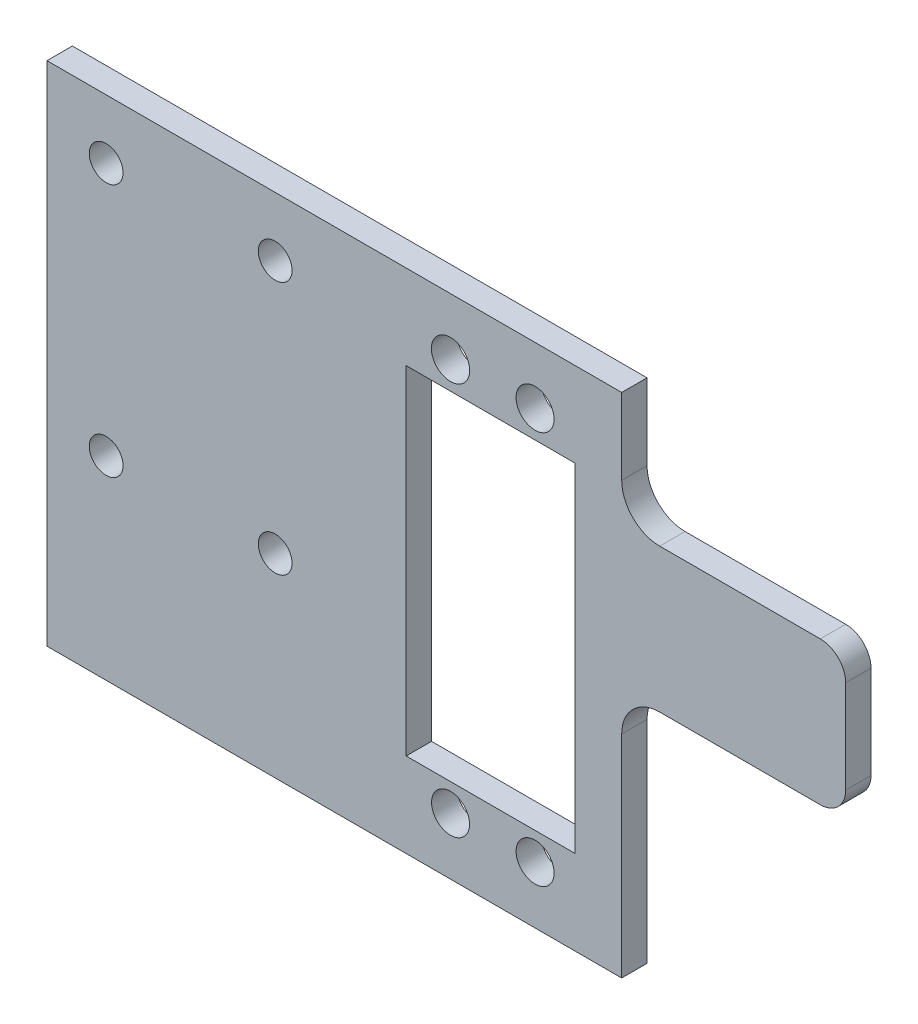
ISO-10303-21;
HEADER;
FILE_DESCRIPTION(('STEP AP214'),'2;1');
FILE_NAME('part.step','',(''),(''),'','','');
FILE_SCHEMA(('AUTOMOTIVE_DESIGN { 1 0 10303 214 1 1 1 1 }'));
ENDSEC;
DATA;
#1=APPLICATION_CONTEXT('core data for automotive mechanical design processes');
#2=APPLICATION_PROTOCOL_DEFINITION('international standard','automotive_design',2000,#1);
#3=PRODUCT_CONTEXT('',#1,'mechanical');
#4=PRODUCT('Part','Part','',(#3));
#5=PRODUCT_RELATED_PRODUCT_CATEGORY('part','',(#4));
#6=PRODUCT_DEFINITION_FORMATION('','',#4);
#7=PRODUCT_DEFINITION_CONTEXT('part definition',#1,'design');
#8=PRODUCT_DEFINITION('design','',#6,#7);
#9=PRODUCT_DEFINITION_SHAPE('','',#8);
#10=(LENGTH_UNIT() NAMED_UNIT(*) SI_UNIT(.MILLI.,.METRE.));
#11=(NAMED_UNIT(*) PLANE_ANGLE_UNIT() SI_UNIT($,.RADIAN.));
#12=(NAMED_UNIT(*) SI_UNIT($,.STERADIAN.) SOLID_ANGLE_UNIT());
#13=UNCERTAINTY_MEASURE_WITH_UNIT(LENGTH_MEASURE(1.E-05),#10,'distance_accuracy_value','');
#14=(GEOMETRIC_REPRESENTATION_CONTEXT(3) GLOBAL_UNCERTAINTY_ASSIGNED_CONTEXT((#13)) GLOBAL_UNIT_ASSIGNED_CONTEXT((#10,
#11,#12)) REPRESENTATION_CONTEXT('',''));
#15=CARTESIAN_POINT('',(0.,0.,0.));
#16=DIRECTION('',(0.,0.,1.));
#17=DIRECTION('',(1.,0.,0.));
#18=AXIS2_PLACEMENT_3D('',#15,#16,#17);
#19=CARTESIAN_POINT('',(0.,32.2205240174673,3.));
#20=DIRECTION('',(0.,-1.,0.));
#21=DIRECTION('',(0.,0.,-1.));
#22=AXIS2_PLACEMENT_3D('',#19,#20,#21);
#23=PLANE('',#22);
#24=DIRECTION('',(-1.,0.,0.));
#25=VECTOR('',#24,1.);
#26=CARTESIAN_POINT('',(0.,32.2205240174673,0.));
#27=LINE('',#26,#25);
#28=CARTESIAN_POINT('',(5.56113537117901,32.2205240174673,0.));
#29=VERTEX_POINT('',#28);
#30=CARTESIAN_POINT('',(-13.4388646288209,32.2205240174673,0.));
#31=VERTEX_POINT('',#30);
#32=EDGE_CURVE('E218',#29,#31,#27,.T.);
#33=ORIENTED_EDGE('',*,*,#32,.T.);
#34=DIRECTION('',(0.,0.,-1.));
#35=VECTOR('',#34,1.);
#36=CARTESIAN_POINT('',(-13.4388646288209,32.2205240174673,3.));
#37=LINE('',#36,#35);
#38=CARTESIAN_POINT('',(-13.4388646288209,32.2205240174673,3.));
#39=VERTEX_POINT('',#38);
#40=EDGE_CURVE('E11',#39,#31,#37,.T.);
#41=ORIENTED_EDGE('',*,*,#40,.F.);
#42=DIRECTION('',(-1.,0.,0.));
#43=VECTOR('',#42,1.);
#44=CARTESIAN_POINT('',(0.,32.2205240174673,3.));
#45=LINE('',#44,#43);
#46=CARTESIAN_POINT('',(5.56113537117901,32.2205240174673,3.));
#47=VERTEX_POINT('',#46);
#48=EDGE_CURVE('E310',#47,#39,#45,.T.);
#49=ORIENTED_EDGE('',*,*,#48,.F.);
#50=DIRECTION('',(0.,0.,-1.));
#51=VECTOR('',#50,1.);
#52=CARTESIAN_POINT('',(5.56113537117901,32.2205240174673,3.));
#53=LINE('',#52,#51);
#54=EDGE_CURVE('E249',#47,#29,#53,.T.);
#55=ORIENTED_EDGE('',*,*,#54,.T.);
#56=EDGE_LOOP('',(#33,#41,#49,#55));
#57=FACE_BOUND('',#56,.T.);
#58=ADVANCED_FACE('F35',(#57),#23,.F.);
#59=CARTESIAN_POINT('',(-13.4388646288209,36.7205240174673,3.));
#60=DIRECTION('',(0.,0.,-1.));
#61=DIRECTION('',(-1.,0.,0.));
#62=AXIS2_PLACEMENT_3D('',#59,#60,#61);
#63=CYLINDRICAL_SURFACE('',#62,4.5);
#64=CARTESIAN_POINT('',(-13.4388646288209,36.7205240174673,0.));
#65=DIRECTION('',(0.,0.,1.));
#66=DIRECTION('',(1.,0.,0.));
#67=AXIS2_PLACEMENT_3D('',#64,#65,#66);
#68=CIRCLE('',#67,4.5);
#69=CARTESIAN_POINT('',(-17.9388646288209,36.7205240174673,0.));
#70=VERTEX_POINT('',#69);
#71=EDGE_CURVE('E221',#31,#70,#68,.F.);
#72=ORIENTED_EDGE('',*,*,#71,.T.);
#73=DIRECTION('',(0.,0.,-1.));
#74=VECTOR('',#73,1.);
#75=CARTESIAN_POINT('',(-17.9388646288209,36.7205240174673,3.));
#76=LINE('',#75,#74);
#77=CARTESIAN_POINT('',(-17.9388646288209,36.7205240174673,3.));
#78=VERTEX_POINT('',#77);
#79=EDGE_CURVE('E45',#78,#70,#76,.T.);
#80=ORIENTED_EDGE('',*,*,#79,.F.);
#81=CARTESIAN_POINT('',(-13.4388646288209,36.7205240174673,3.));
#82=DIRECTION('',(0.,0.,1.));
#83=DIRECTION('',(1.,0.,0.));
#84=AXIS2_PLACEMENT_3D('',#81,#82,#83);
#85=CIRCLE('',#84,4.5);
#86=EDGE_CURVE('E312',#39,#78,#85,.F.);
#87=ORIENTED_EDGE('',*,*,#86,.F.);
#88=ORIENTED_EDGE('',*,*,#40,.T.);
#89=EDGE_LOOP('',(#72,#80,#87,#88));
#90=FACE_BOUND('',#89,.T.);
#91=ADVANCED_FACE('F352',(#90),#63,.F.);
#92=CARTESIAN_POINT('',(-17.9388646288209,0.,3.));
#93=DIRECTION('',(1.,0.,0.));
#94=DIRECTION('',(0.,1.,0.));
#95=AXIS2_PLACEMENT_3D('',#92,#93,#94);
#96=PLANE('',#95);
#97=DIRECTION('',(0.,-1.,0.));
#98=VECTOR('',#97,1.);
#99=CARTESIAN_POINT('',(-17.9388646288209,0.,0.));
#100=LINE('',#99,#98);
#101=CARTESIAN_POINT('',(-17.938864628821,45.7205240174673,0.));
#102=VERTEX_POINT('',#101);
#103=EDGE_CURVE('E224',#102,#70,#100,.T.);
#104=ORIENTED_EDGE('',*,*,#103,.F.);
#105=DIRECTION('',(0.,0.,-1.));
#106=VECTOR('',#105,1.);
#107=CARTESIAN_POINT('',(-17.938864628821,45.7205240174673,3.));
#108=LINE('',#107,#106);
#109=CARTESIAN_POINT('',(-17.938864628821,45.7205240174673,3.));
#110=VERTEX_POINT('',#109);
#111=EDGE_CURVE('E264',#110,#102,#108,.T.);
#112=ORIENTED_EDGE('',*,*,#111,.F.);
#113=DIRECTION('',(0.,-1.,0.));
#114=VECTOR('',#113,1.);
#115=CARTESIAN_POINT('',(-17.9388646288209,0.,3.));
#116=LINE('',#115,#114);
#117=EDGE_CURVE('E314',#110,#78,#116,.T.);
#118=ORIENTED_EDGE('',*,*,#117,.T.);
#119=ORIENTED_EDGE('',*,*,#79,.T.);
#120=EDGE_LOOP('',(#104,#112,#118,#119));
#121=FACE_BOUND('',#120,.T.);
#122=ADVANCED_FACE('F357',(#121),#96,.T.);
#123=CARTESIAN_POINT('',(0.,45.7205240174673,3.));
#124=DIRECTION('',(0.,1.,0.));
#125=DIRECTION('',(0.,0.,1.));
#126=AXIS2_PLACEMENT_3D('',#123,#124,#125);
#127=PLANE('',#126);
#128=DIRECTION('',(1.,0.,0.));
#129=VECTOR('',#128,1.);
#130=CARTESIAN_POINT('',(0.,45.7205240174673,0.));
#131=LINE('',#130,#129);
#132=CARTESIAN_POINT('',(-85.938864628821,45.7205240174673,0.));
#133=VERTEX_POINT('',#132);
#134=EDGE_CURVE('E227',#133,#102,#131,.T.);
#135=ORIENTED_EDGE('',*,*,#134,.F.);
#136=DIRECTION('',(0.,0.,-1.));
#137=VECTOR('',#136,1.);
#138=CARTESIAN_POINT('',(-85.938864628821,45.7205240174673,3.));
#139=LINE('',#138,#137);
#140=CARTESIAN_POINT('',(-85.938864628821,45.7205240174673,3.));
#141=VERTEX_POINT('',#140);
#142=EDGE_CURVE('E262',#141,#133,#139,.T.);
#143=ORIENTED_EDGE('',*,*,#142,.F.);
#144=DIRECTION('',(1.,0.,0.));
#145=VECTOR('',#144,1.);
#146=CARTESIAN_POINT('',(0.,45.7205240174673,3.));
#147=LINE('',#146,#145);
#148=EDGE_CURVE('E317',#141,#110,#147,.T.);
#149=ORIENTED_EDGE('',*,*,#148,.T.);
#150=ORIENTED_EDGE('',*,*,#111,.T.);
#151=EDGE_LOOP('',(#135,#143,#149,#150));
#152=FACE_BOUND('',#151,.T.);
#153=ADVANCED_FACE('F559',(#152),#127,.T.);
#154=CARTESIAN_POINT('',(-85.9388646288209,0.,3.));
#155=DIRECTION('',(1.,0.,0.));
#156=DIRECTION('',(0.,1.,0.));
#157=AXIS2_PLACEMENT_3D('',#154,#155,#156);
#158=PLANE('',#157);
#159=DIRECTION('',(0.,-1.,0.));
#160=VECTOR('',#159,1.);
#161=CARTESIAN_POINT('',(-85.9388646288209,0.,0.));
#162=LINE('',#161,#160);
#163=CARTESIAN_POINT('',(-85.9388646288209,-14.2794759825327,0.));
#164=VERTEX_POINT('',#163);
#165=EDGE_CURVE('E230',#133,#164,#162,.T.);
#166=ORIENTED_EDGE('',*,*,#165,.T.);
#167=DIRECTION('',(0.,0.,-1.));
#168=VECTOR('',#167,1.);
#169=CARTESIAN_POINT('',(-85.9388646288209,-14.2794759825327,3.));
#170=LINE('',#169,#168);
#171=CARTESIAN_POINT('',(-85.9388646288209,-14.2794759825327,3.));
#172=VERTEX_POINT('',#171);
#173=EDGE_CURVE('E259',#172,#164,#170,.T.);
#174=ORIENTED_EDGE('',*,*,#173,.F.);
#175=DIRECTION('',(0.,-1.,0.));
#176=VECTOR('',#175,1.);
#177=CARTESIAN_POINT('',(-85.9388646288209,0.,3.));
#178=LINE('',#177,#176);
#179=EDGE_CURVE('E320',#141,#172,#178,.T.);
#180=ORIENTED_EDGE('',*,*,#179,.F.);
#181=ORIENTED_EDGE('',*,*,#142,.T.);
#182=EDGE_LOOP('',(#166,#174,#180,#181));
#183=FACE_BOUND('',#182,.T.);
#184=ADVANCED_FACE('F548',(#183),#158,.F.);
#185=CARTESIAN_POINT('',(0.,-14.2794759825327,3.));
#186=DIRECTION('',(0.,1.,0.));
#187=DIRECTION('',(0.,0.,1.));
#188=AXIS2_PLACEMENT_3D('',#185,#186,#187);
#189=PLANE('',#188);
#190=DIRECTION('',(1.,0.,0.));
#191=VECTOR('',#190,1.);
#192=CARTESIAN_POINT('',(0.,-14.2794759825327,0.));
#193=LINE('',#192,#191);
#194=CARTESIAN_POINT('',(-17.9388646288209,-14.2794759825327,0.));
#195=VERTEX_POINT('',#194);
#196=EDGE_CURVE('E232',#164,#195,#193,.T.);
#197=ORIENTED_EDGE('',*,*,#196,.T.);
#198=DIRECTION('',(0.,0.,-1.));
#199=VECTOR('',#198,1.);
#200=CARTESIAN_POINT('',(-17.9388646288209,-14.2794759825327,3.));
#201=LINE('',#200,#199);
#202=CARTESIAN_POINT('',(-17.9388646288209,-14.2794759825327,3.));
#203=VERTEX_POINT('',#202);
#204=EDGE_CURVE('E257',#203,#195,#201,.T.);
#205=ORIENTED_EDGE('',*,*,#204,.F.);
#206=DIRECTION('',(1.,0.,0.));
#207=VECTOR('',#206,1.);
#208=CARTESIAN_POINT('',(0.,-14.2794759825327,3.));
#209=LINE('',#208,#207);
#210=EDGE_CURVE('E322',#172,#203,#209,.T.);
#211=ORIENTED_EDGE('',*,*,#210,.F.);
#212=ORIENTED_EDGE('',*,*,#173,.T.);
#213=EDGE_LOOP('',(#197,#205,#211,#212));
#214=FACE_BOUND('',#213,.T.);
#215=ADVANCED_FACE('F538',(#214),#189,.F.);
#216=CARTESIAN_POINT('',(-17.9388646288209,0.,3.));
#217=DIRECTION('',(1.,0.,0.));
#218=DIRECTION('',(0.,0.,-1.));
#219=AXIS2_PLACEMENT_3D('',#216,#217,#218);
#220=PLANE('',#219);
#221=DIRECTION('',(0.,-1.,0.));
#222=VECTOR('',#221,1.);
#223=CARTESIAN_POINT('',(-17.9388646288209,0.,0.));
#224=LINE('',#223,#222);
#225=CARTESIAN_POINT('',(-17.9388646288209,10.7205240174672,0.));
#226=VERTEX_POINT('',#225);
#227=EDGE_CURVE('E235',#226,#195,#224,.T.);
#228=ORIENTED_EDGE('',*,*,#227,.F.);
#229=DIRECTION('',(0.,0.,-1.));
#230=VECTOR('',#229,1.);
#231=CARTESIAN_POINT('',(-17.9388646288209,10.7205240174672,3.));
#232=LINE('',#231,#230);
#233=CARTESIAN_POINT('',(-17.9388646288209,10.7205240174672,3.));
#234=VERTEX_POINT('',#233);
#235=EDGE_CURVE('E255',#234,#226,#232,.T.);
#236=ORIENTED_EDGE('',*,*,#235,.F.);
#237=DIRECTION('',(0.,-1.,0.));
#238=VECTOR('',#237,1.);
#239=CARTESIAN_POINT('',(-17.9388646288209,0.,3.));
#240=LINE('',#239,#238);
#241=EDGE_CURVE('E324',#234,#203,#240,.T.);
#242=ORIENTED_EDGE('',*,*,#241,.T.);
#243=ORIENTED_EDGE('',*,*,#204,.T.);
#244=EDGE_LOOP('',(#228,#236,#242,#243));
#245=FACE_BOUND('',#244,.T.);
#246=ADVANCED_FACE('F528',(#245),#220,.T.);
#247=CARTESIAN_POINT('',(-13.4388646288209,10.7205240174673,3.));
#248=DIRECTION('',(0.,0.,-1.));
#249=DIRECTION('',(-1.,0.,0.));
#250=AXIS2_PLACEMENT_3D('',#247,#248,#249);
#251=CYLINDRICAL_SURFACE('',#250,4.5);
#252=CARTESIAN_POINT('',(-13.4388646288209,10.7205240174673,0.));
#253=DIRECTION('',(0.,0.,1.));
#254=DIRECTION('',(1.,0.,0.));
#255=AXIS2_PLACEMENT_3D('',#252,#253,#254);
#256=CIRCLE('',#255,4.5);
#257=CARTESIAN_POINT('',(-13.4388646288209,15.2205240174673,0.));
#258=VERTEX_POINT('',#257);
#259=EDGE_CURVE('E238',#258,#226,#256,.T.);
#260=ORIENTED_EDGE('',*,*,#259,.F.);
#261=DIRECTION('',(0.,0.,-1.));
#262=VECTOR('',#261,1.);
#263=CARTESIAN_POINT('',(-13.4388646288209,15.2205240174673,3.));
#264=LINE('',#263,#262);
#265=CARTESIAN_POINT('',(-13.4388646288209,15.2205240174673,3.));
#266=VERTEX_POINT('',#265);
#267=EDGE_CURVE('E253',#266,#258,#264,.T.);
#268=ORIENTED_EDGE('',*,*,#267,.F.);
#269=CARTESIAN_POINT('',(-13.4388646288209,10.7205240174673,3.));
#270=DIRECTION('',(0.,0.,1.));
#271=DIRECTION('',(1.,0.,0.));
#272=AXIS2_PLACEMENT_3D('',#269,#270,#271);
#273=CIRCLE('',#272,4.5);
#274=EDGE_CURVE('E327',#266,#234,#273,.T.);
#275=ORIENTED_EDGE('',*,*,#274,.T.);
#276=ORIENTED_EDGE('',*,*,#235,.T.);
#277=EDGE_LOOP('',(#260,#268,#275,#276));
#278=FACE_BOUND('',#277,.T.);
#279=ADVANCED_FACE('F519',(#278),#251,.F.);
#280=CARTESIAN_POINT('',(0.,15.2205240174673,3.));
#281=DIRECTION('',(0.,-1.,0.));
#282=DIRECTION('',(1.,0.,0.));
#283=AXIS2_PLACEMENT_3D('',#280,#281,#282);
#284=PLANE('',#283);
#285=DIRECTION('',(-1.,0.,0.));
#286=VECTOR('',#285,1.);
#287=CARTESIAN_POINT('',(0.,15.2205240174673,0.));
#288=LINE('',#287,#286);
#289=CARTESIAN_POINT('',(5.56113537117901,15.2205240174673,0.));
#290=VERTEX_POINT('',#289);
#291=EDGE_CURVE('E241',#290,#258,#288,.T.);
#292=ORIENTED_EDGE('',*,*,#291,.F.);
#293=DIRECTION('',(0.,0.,-1.));
#294=VECTOR('',#293,1.);
#295=CARTESIAN_POINT('',(5.56113537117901,15.2205240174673,3.));
#296=LINE('',#295,#294);
#297=CARTESIAN_POINT('',(5.56113537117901,15.2205240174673,3.));
#298=VERTEX_POINT('',#297);
#299=EDGE_CURVE('E167',#298,#290,#296,.T.);
#300=ORIENTED_EDGE('',*,*,#299,.F.);
#301=DIRECTION('',(-1.,0.,0.));
#302=VECTOR('',#301,1.);
#303=CARTESIAN_POINT('',(0.,15.2205240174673,3.));
#304=LINE('',#303,#302);
#305=EDGE_CURVE('E174',#298,#266,#304,.T.);
#306=ORIENTED_EDGE('',*,*,#305,.T.);
#307=ORIENTED_EDGE('',*,*,#267,.T.);
#308=EDGE_LOOP('',(#292,#300,#306,#307));
#309=FACE_BOUND('',#308,.T.);
#310=ADVANCED_FACE('F331',(#309),#284,.T.);
#311=CARTESIAN_POINT('',(5.56113537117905,18.2205240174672,3.));
#312=DIRECTION('',(0.,0.,-1.));
#313=DIRECTION('',(-1.,0.,0.));
#314=AXIS2_PLACEMENT_3D('',#311,#312,#313);
#315=CYLINDRICAL_SURFACE('',#314,2.99999999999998);
#316=CARTESIAN_POINT('',(5.56113537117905,18.2205240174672,0.));
#317=DIRECTION('',(0.,0.,1.));
#318=DIRECTION('',(1.,0.,0.));
#319=AXIS2_PLACEMENT_3D('',#316,#317,#318);
#320=CIRCLE('',#319,2.99999999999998);
#321=CARTESIAN_POINT('',(8.56113537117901,18.2205240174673,0.));
#322=VERTEX_POINT('',#321);
#323=EDGE_CURVE('E162',#322,#290,#320,.F.);
#324=ORIENTED_EDGE('',*,*,#323,.F.);
#325=DIRECTION('',(0.,0.,-1.));
#326=VECTOR('',#325,1.);
#327=CARTESIAN_POINT('',(8.56113537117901,18.2205240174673,3.));
#328=LINE('',#327,#326);
#329=CARTESIAN_POINT('',(8.56113537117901,18.2205240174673,3.));
#330=VERTEX_POINT('',#329);
#331=EDGE_CURVE('E157',#330,#322,#328,.T.);
#332=ORIENTED_EDGE('',*,*,#331,.F.);
#333=CARTESIAN_POINT('',(5.56113537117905,18.2205240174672,3.));
#334=DIRECTION('',(0.,0.,1.));
#335=DIRECTION('',(1.,0.,0.));
#336=AXIS2_PLACEMENT_3D('',#333,#334,#335);
#337=CIRCLE('',#336,2.99999999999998);
#338=EDGE_CURVE('E160',#330,#298,#337,.F.);
#339=ORIENTED_EDGE('',*,*,#338,.T.);
#340=ORIENTED_EDGE('',*,*,#299,.T.);
#341=EDGE_LOOP('',(#324,#332,#339,#340));
#342=FACE_BOUND('',#341,.T.);
#343=ADVANCED_FACE('F159',(#342),#315,.T.);
#344=CARTESIAN_POINT('',(8.56113537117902,0.,3.));
#345=DIRECTION('',(1.,0.,0.));
#346=DIRECTION('',(0.,1.,0.));
#347=AXIS2_PLACEMENT_3D('',#344,#345,#346);
#348=PLANE('',#347);
#349=DIRECTION('',(0.,-1.,0.));
#350=VECTOR('',#349,1.);
#351=CARTESIAN_POINT('',(8.56113537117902,0.,0.));
#352=LINE('',#351,#350);
#353=CARTESIAN_POINT('',(8.56113537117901,29.2205240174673,0.));
#354=VERTEX_POINT('',#353);
#355=EDGE_CURVE('E245',#354,#322,#352,.T.);
#356=ORIENTED_EDGE('',*,*,#355,.F.);
#357=DIRECTION('',(0.,0.,-1.));
#358=VECTOR('',#357,1.);
#359=CARTESIAN_POINT('',(8.56113537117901,29.2205240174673,3.));
#360=LINE('',#359,#358);
#361=CARTESIAN_POINT('',(8.56113537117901,29.2205240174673,3.));
#362=VERTEX_POINT('',#361);
#363=EDGE_CURVE('E106',#362,#354,#360,.T.);
#364=ORIENTED_EDGE('',*,*,#363,.F.);
#365=DIRECTION('',(0.,-1.,0.));
#366=VECTOR('',#365,1.);
#367=CARTESIAN_POINT('',(8.56113537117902,0.,3.));
#368=LINE('',#367,#366);
#369=EDGE_CURVE('E171',#362,#330,#368,.T.);
#370=ORIENTED_EDGE('',*,*,#369,.T.);
#371=ORIENTED_EDGE('',*,*,#331,.T.);
#372=EDGE_LOOP('',(#356,#364,#370,#371));
#373=FACE_BOUND('',#372,.T.);
#374=ADVANCED_FACE('F176',(#373),#348,.T.);
#375=CARTESIAN_POINT('',(-23.438864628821,0.,3.));
#376=DIRECTION('',(-1.,0.,0.));
#377=DIRECTION('',(0.,0.,1.));
#378=AXIS2_PLACEMENT_3D('',#375,#376,#377);
#379=PLANE('',#378);
#380=DIRECTION('',(0.,1.,0.));
#381=VECTOR('',#380,1.);
#382=CARTESIAN_POINT('',(-23.438864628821,0.,0.));
#383=LINE('',#382,#381);
#384=CARTESIAN_POINT('',(-23.438864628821,-4.27947598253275,0.));
#385=VERTEX_POINT('',#384);
#386=CARTESIAN_POINT('',(-23.438864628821,35.7205240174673,0.));
#387=VERTEX_POINT('',#386);
#388=EDGE_CURVE('E194',#385,#387,#383,.T.);
#389=ORIENTED_EDGE('',*,*,#388,.F.);
#390=DIRECTION('',(0.,0.,-1.));
#391=VECTOR('',#390,1.);
#392=CARTESIAN_POINT('',(-23.438864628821,-4.27947598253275,3.));
#393=LINE('',#392,#391);
#394=CARTESIAN_POINT('',(-23.438864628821,-4.27947598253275,3.));
#395=VERTEX_POINT('',#394);
#396=EDGE_CURVE('E39',#395,#385,#393,.T.);
#397=ORIENTED_EDGE('',*,*,#396,.F.);
#398=DIRECTION('',(0.,1.,0.));
#399=VECTOR('',#398,1.);
#400=CARTESIAN_POINT('',(-23.438864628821,0.,3.));
#401=LINE('',#400,#399);
#402=CARTESIAN_POINT('',(-23.438864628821,35.7205240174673,3.));
#403=VERTEX_POINT('',#402);
#404=EDGE_CURVE('E629',#395,#403,#401,.T.);
#405=ORIENTED_EDGE('',*,*,#404,.T.);
#406=DIRECTION('',(0.,0.,-1.));
#407=VECTOR('',#406,1.);
#408=CARTESIAN_POINT('',(-23.438864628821,35.7205240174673,3.));
#409=LINE('',#408,#407);
#410=EDGE_CURVE('E178',#403,#387,#409,.T.);
#411=ORIENTED_EDGE('',*,*,#410,.T.);
#412=EDGE_LOOP('',(#389,#397,#405,#411));
#413=FACE_BOUND('',#412,.T.);
#414=ADVANCED_FACE('F279',(#413),#379,.T.);
#415=CARTESIAN_POINT('',(0.,-4.27947598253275,3.));
#416=DIRECTION('',(0.,1.,0.));
#417=DIRECTION('',(0.,0.,1.));
#418=AXIS2_PLACEMENT_3D('',#415,#416,#417);
#419=PLANE('',#418);
#420=DIRECTION('',(1.,0.,0.));
#421=VECTOR('',#420,1.);
#422=CARTESIAN_POINT('',(0.,-4.27947598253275,0.));
#423=LINE('',#422,#421);
#424=CARTESIAN_POINT('',(-43.438864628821,-4.27947598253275,0.));
#425=VERTEX_POINT('',#424);
#426=EDGE_CURVE('E197',#425,#385,#423,.T.);
#427=ORIENTED_EDGE('',*,*,#426,.F.);
#428=DIRECTION('',(0.,0.,-1.));
#429=VECTOR('',#428,1.);
#430=CARTESIAN_POINT('',(-43.438864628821,-4.27947598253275,3.));
#431=LINE('',#430,#429);
#432=CARTESIAN_POINT('',(-43.438864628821,-4.27947598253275,3.));
#433=VERTEX_POINT('',#432);
#434=EDGE_CURVE('E269',#433,#425,#431,.T.);
#435=ORIENTED_EDGE('',*,*,#434,.F.);
#436=DIRECTION('',(1.,0.,0.));
#437=VECTOR('',#436,1.);
#438=CARTESIAN_POINT('',(0.,-4.27947598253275,3.));
#439=LINE('',#438,#437);
#440=EDGE_CURVE('E278',#433,#395,#439,.T.);
#441=ORIENTED_EDGE('',*,*,#440,.T.);
#442=ORIENTED_EDGE('',*,*,#396,.T.);
#443=EDGE_LOOP('',(#427,#435,#441,#442));
#444=FACE_BOUND('',#443,.T.);
#445=ADVANCED_FACE('F276',(#444),#419,.T.);
#446=CARTESIAN_POINT('',(-43.438864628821,0.,3.));
#447=DIRECTION('',(1.,0.,0.));
#448=DIRECTION('',(0.,0.,-1.));
#449=AXIS2_PLACEMENT_3D('',#446,#447,#448);
#450=PLANE('',#449);
#451=DIRECTION('',(0.,-1.,0.));
#452=VECTOR('',#451,1.);
#453=CARTESIAN_POINT('',(-43.438864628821,0.,0.));
#454=LINE('',#453,#452);
#455=CARTESIAN_POINT('',(-43.438864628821,35.7205240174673,0.));
#456=VERTEX_POINT('',#455);
#457=EDGE_CURVE('E200',#456,#425,#454,.T.);
#458=ORIENTED_EDGE('',*,*,#457,.F.);
#459=DIRECTION('',(0.,0.,-1.));
#460=VECTOR('',#459,1.);
#461=CARTESIAN_POINT('',(-43.438864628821,35.7205240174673,3.));
#462=LINE('',#461,#460);
#463=CARTESIAN_POINT('',(-43.438864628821,35.7205240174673,3.));
#464=VERTEX_POINT('',#463);
#465=EDGE_CURVE('E268',#464,#456,#462,.T.);
#466=ORIENTED_EDGE('',*,*,#465,.F.);
#467=DIRECTION('',(0.,-1.,0.));
#468=VECTOR('',#467,1.);
#469=CARTESIAN_POINT('',(-43.438864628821,0.,3.));
#470=LINE('',#469,#468);
#471=EDGE_CURVE('E286',#464,#433,#470,.T.);
#472=ORIENTED_EDGE('',*,*,#471,.T.);
#473=ORIENTED_EDGE('',*,*,#434,.T.);
#474=EDGE_LOOP('',(#458,#466,#472,#473));
#475=FACE_BOUND('',#474,.T.);
#476=ADVANCED_FACE('F284',(#475),#450,.T.);
#477=CARTESIAN_POINT('',(-58.938864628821,8.72052401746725,3.));
#478=DIRECTION('',(0.,0.,-1.));
#479=DIRECTION('',(-1.,0.,0.));
#480=AXIS2_PLACEMENT_3D('',#477,#478,#479);
#481=CYLINDRICAL_SURFACE('',#480,2.);
#482=CARTESIAN_POINT('',(-58.938864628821,8.72052401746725,3.));
#483=DIRECTION('',(0.,0.,1.));
#484=DIRECTION('',(1.,0.,0.));
#485=AXIS2_PLACEMENT_3D('',#482,#483,#484);
#486=CIRCLE('',#485,2.);
#487=CARTESIAN_POINT('',(-56.938864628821,8.72052401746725,3.));
#488=VERTEX_POINT('',#487);
#489=EDGE_CURVE('E307',#488,#488,#486,.T.);
#490=ORIENTED_EDGE('',*,*,#489,.T.);
#491=EDGE_LOOP('',(#490));
#492=FACE_BOUND('',#491,.T.);
#493=CARTESIAN_POINT('',(-58.938864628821,8.72052401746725,0.));
#494=DIRECTION('',(0.,0.,1.));
#495=DIRECTION('',(1.,0.,0.));
#496=AXIS2_PLACEMENT_3D('',#493,#494,#495);
#497=CIRCLE('',#496,2.);
#498=CARTESIAN_POINT('',(-56.938864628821,8.72052401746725,0.));
#499=VERTEX_POINT('',#498);
#500=EDGE_CURVE('E215',#499,#499,#497,.T.);
#501=ORIENTED_EDGE('',*,*,#500,.F.);
#502=EDGE_LOOP('',(#501));
#503=FACE_BOUND('',#502,.T.);
#504=ADVANCED_FACE('F362',(#492,#503),#481,.F.);
#505=CARTESIAN_POINT('',(-58.938864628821,38.7205240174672,3.));
#506=DIRECTION('',(0.,0.,-1.));
#507=DIRECTION('',(-1.,0.,0.));
#508=AXIS2_PLACEMENT_3D('',#505,#506,#507);
#509=CYLINDRICAL_SURFACE('',#508,2.);
#510=CARTESIAN_POINT('',(-58.938864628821,38.7205240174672,3.));
#511=DIRECTION('',(0.,0.,1.));
#512=DIRECTION('',(1.,0.,0.));
#513=AXIS2_PLACEMENT_3D('',#510,#511,#512);
#514=CIRCLE('',#513,2.);
#515=CARTESIAN_POINT('',(-56.938864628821,38.7205240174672,3.));
#516=VERTEX_POINT('',#515);
#517=EDGE_CURVE('E304',#516,#516,#514,.T.);
#518=ORIENTED_EDGE('',*,*,#517,.T.);
#519=EDGE_LOOP('',(#518));
#520=FACE_BOUND('',#519,.T.);
#521=CARTESIAN_POINT('',(-58.938864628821,38.7205240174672,0.));
#522=DIRECTION('',(0.,0.,1.));
#523=DIRECTION('',(1.,0.,0.));
#524=AXIS2_PLACEMENT_3D('',#521,#522,#523);
#525=CIRCLE('',#524,2.);
#526=CARTESIAN_POINT('',(-56.938864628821,38.7205240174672,0.));
#527=VERTEX_POINT('',#526);
#528=EDGE_CURVE('E212',#527,#527,#525,.T.);
#529=ORIENTED_EDGE('',*,*,#528,.F.);
#530=EDGE_LOOP('',(#529));
#531=FACE_BOUND('',#530,.T.);
#532=ADVANCED_FACE('F365',(#520,#531),#509,.F.);
#533=CARTESIAN_POINT('',(-78.938864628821,8.72052401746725,3.));
#534=DIRECTION('',(0.,0.,-1.));
#535=DIRECTION('',(-1.,0.,0.));
#536=AXIS2_PLACEMENT_3D('',#533,#534,#535);
#537=CYLINDRICAL_SURFACE('',#536,2.);
#538=CARTESIAN_POINT('',(-78.938864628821,8.72052401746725,3.));
#539=DIRECTION('',(0.,0.,1.));
#540=DIRECTION('',(1.,0.,0.));
#541=AXIS2_PLACEMENT_3D('',#538,#539,#540);
#542=CIRCLE('',#541,2.);
#543=CARTESIAN_POINT('',(-76.938864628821,8.72052401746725,3.));
#544=VERTEX_POINT('',#543);
#545=EDGE_CURVE('E298',#544,#544,#542,.T.);
#546=ORIENTED_EDGE('',*,*,#545,.T.);
#547=EDGE_LOOP('',(#546));
#548=FACE_BOUND('',#547,.T.);
#549=CARTESIAN_POINT('',(-78.938864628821,8.72052401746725,0.));
#550=DIRECTION('',(0.,0.,1.));
#551=DIRECTION('',(1.,0.,0.));
#552=AXIS2_PLACEMENT_3D('',#549,#550,#551);
#553=CIRCLE('',#552,2.);
#554=CARTESIAN_POINT('',(-76.938864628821,8.72052401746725,0.));
#555=VERTEX_POINT('',#554);
#556=EDGE_CURVE('E209',#555,#555,#553,.T.);
#557=ORIENTED_EDGE('',*,*,#556,.F.);
#558=EDGE_LOOP('',(#557));
#559=FACE_BOUND('',#558,.T.);
#560=ADVANCED_FACE('F369',(#548,#559),#537,.F.);
#561=CARTESIAN_POINT('',(-78.938864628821,38.7205240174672,3.));
#562=DIRECTION('',(0.,0.,-1.));
#563=DIRECTION('',(-1.,0.,0.));
#564=AXIS2_PLACEMENT_3D('',#561,#562,#563);
#565=CYLINDRICAL_SURFACE('',#564,2.);
#566=CARTESIAN_POINT('',(-78.938864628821,38.7205240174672,3.));
#567=DIRECTION('',(0.,0.,1.));
#568=DIRECTION('',(1.,0.,0.));
#569=AXIS2_PLACEMENT_3D('',#566,#567,#568);
#570=CIRCLE('',#569,2.);
#571=CARTESIAN_POINT('',(-76.938864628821,38.7205240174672,3.));
#572=VERTEX_POINT('',#571);
#573=EDGE_CURVE('E295',#572,#572,#570,.T.);
#574=ORIENTED_EDGE('',*,*,#573,.T.);
#575=EDGE_LOOP('',(#574));
#576=FACE_BOUND('',#575,.T.);
#577=CARTESIAN_POINT('',(-78.938864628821,38.7205240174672,0.));
#578=DIRECTION('',(0.,0.,1.));
#579=DIRECTION('',(1.,0.,0.));
#580=AXIS2_PLACEMENT_3D('',#577,#578,#579);
#581=CIRCLE('',#580,2.);
#582=CARTESIAN_POINT('',(-76.938864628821,38.7205240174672,0.));
#583=VERTEX_POINT('',#582);
#584=EDGE_CURVE('E206',#583,#583,#581,.T.);
#585=ORIENTED_EDGE('',*,*,#584,.F.);
#586=EDGE_LOOP('',(#585));
#587=FACE_BOUND('',#586,.T.);
#588=ADVANCED_FACE('F373',(#576,#587),#565,.F.);
#589=CARTESIAN_POINT('',(0.,35.7205240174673,3.));
#590=DIRECTION('',(0.,-1.,0.));
#591=DIRECTION('',(0.,0.,-1.));
#592=AXIS2_PLACEMENT_3D('',#589,#590,#591);
#593=PLANE('',#592);
#594=DIRECTION('',(-1.,0.,0.));
#595=VECTOR('',#594,1.);
#596=CARTESIAN_POINT('',(0.,35.7205240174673,0.));
#597=LINE('',#596,#595);
#598=EDGE_CURVE('E203',#387,#456,#597,.T.);
#599=ORIENTED_EDGE('',*,*,#598,.F.);
#600=ORIENTED_EDGE('',*,*,#410,.F.);
#601=DIRECTION('',(-1.,0.,0.));
#602=VECTOR('',#601,1.);
#603=CARTESIAN_POINT('',(0.,35.7205240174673,3.));
#604=LINE('',#603,#602);
#605=EDGE_CURVE('E292',#403,#464,#604,.T.);
#606=ORIENTED_EDGE('',*,*,#605,.T.);
#607=ORIENTED_EDGE('',*,*,#465,.T.);
#608=EDGE_LOOP('',(#599,#600,#606,#607));
#609=FACE_BOUND('',#608,.T.);
#610=ADVANCED_FACE('F294',(#609),#593,.T.);
#611=CARTESIAN_POINT('',(-28.188864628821,38.9705240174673,3.));
#612=DIRECTION('',(0.,0.,-1.));
#613=DIRECTION('',(-1.,0.,0.));
#614=AXIS2_PLACEMENT_3D('',#611,#612,#613);
#615=CYLINDRICAL_SURFACE('',#614,2.25);
#616=CARTESIAN_POINT('',(-28.188864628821,38.9705240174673,3.));
#617=DIRECTION('',(0.,0.,1.));
#618=DIRECTION('',(1.,0.,0.));
#619=AXIS2_PLACEMENT_3D('',#616,#617,#618);
#620=CIRCLE('',#619,2.25);
#621=CARTESIAN_POINT('',(-25.938864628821,38.9705240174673,3.));
#622=VERTEX_POINT('',#621);
#623=EDGE_CURVE('E622',#622,#622,#620,.T.);
#624=ORIENTED_EDGE('',*,*,#623,.T.);
#625=EDGE_LOOP('',(#624));
#626=FACE_BOUND('',#625,.T.);
#627=CARTESIAN_POINT('',(-28.188864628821,38.9705240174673,0.));
#628=DIRECTION('',(0.,0.,1.));
#629=DIRECTION('',(1.,0.,0.));
#630=AXIS2_PLACEMENT_3D('',#627,#628,#629);
#631=CIRCLE('',#630,2.25);
#632=CARTESIAN_POINT('',(-25.938864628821,38.9705240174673,0.));
#633=VERTEX_POINT('',#632);
#634=EDGE_CURVE('E191',#633,#633,#631,.T.);
#635=ORIENTED_EDGE('',*,*,#634,.F.);
#636=EDGE_LOOP('',(#635));
#637=FACE_BOUND('',#636,.T.);
#638=ADVANCED_FACE('F380',(#626,#637),#615,.F.);
#639=CARTESIAN_POINT('',(-38.188864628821,38.9705240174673,3.));
#640=DIRECTION('',(0.,0.,-1.));
#641=DIRECTION('',(-1.,0.,0.));
#642=AXIS2_PLACEMENT_3D('',#639,#640,#641);
#643=CYLINDRICAL_SURFACE('',#642,2.26384628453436);
#644=CARTESIAN_POINT('',(-38.188864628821,38.9705240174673,3.));
#645=DIRECTION('',(0.,0.,1.));
#646=DIRECTION('',(1.,0.,0.));
#647=AXIS2_PLACEMENT_3D('',#644,#645,#646);
#648=CIRCLE('',#647,2.26384628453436);
#649=CARTESIAN_POINT('',(-35.9250183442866,38.9705240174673,3.));
#650=VERTEX_POINT('',#649);
#651=EDGE_CURVE('E619',#650,#650,#648,.T.);
#652=ORIENTED_EDGE('',*,*,#651,.T.);
#653=EDGE_LOOP('',(#652));
#654=FACE_BOUND('',#653,.T.);
#655=CARTESIAN_POINT('',(-38.188864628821,38.9705240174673,0.));
#656=DIRECTION('',(0.,0.,1.));
#657=DIRECTION('',(1.,0.,0.));
#658=AXIS2_PLACEMENT_3D('',#655,#656,#657);
#659=CIRCLE('',#658,2.26384628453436);
#660=CARTESIAN_POINT('',(-35.9250183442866,38.9705240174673,0.));
#661=VERTEX_POINT('',#660);
#662=EDGE_CURVE('E188',#661,#661,#659,.T.);
#663=ORIENTED_EDGE('',*,*,#662,.F.);
#664=EDGE_LOOP('',(#663));
#665=FACE_BOUND('',#664,.T.);
#666=ADVANCED_FACE('F389',(#654,#665),#643,.F.);
#667=CARTESIAN_POINT('',(-28.188864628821,-7.52947598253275,3.));
#668=DIRECTION('',(0.,0.,-1.));
#669=DIRECTION('',(-1.,0.,0.));
#670=AXIS2_PLACEMENT_3D('',#667,#668,#669);
#671=CYLINDRICAL_SURFACE('',#670,2.25);
#672=CARTESIAN_POINT('',(-28.188864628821,-7.52947598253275,3.));
#673=DIRECTION('',(0.,0.,1.));
#674=DIRECTION('',(1.,0.,0.));
#675=AXIS2_PLACEMENT_3D('',#672,#673,#674);
#676=CIRCLE('',#675,2.25);
#677=CARTESIAN_POINT('',(-25.938864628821,-7.52947598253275,3.));
#678=VERTEX_POINT('',#677);
#679=EDGE_CURVE('E400',#678,#678,#676,.T.);
#680=ORIENTED_EDGE('',*,*,#679,.T.);
#681=EDGE_LOOP('',(#680));
#682=FACE_BOUND('',#681,.T.);
#683=CARTESIAN_POINT('',(-28.188864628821,-7.52947598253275,0.));
#684=DIRECTION('',(0.,0.,1.));
#685=DIRECTION('',(1.,0.,0.));
#686=AXIS2_PLACEMENT_3D('',#683,#684,#685);
#687=CIRCLE('',#686,2.25);
#688=CARTESIAN_POINT('',(-25.938864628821,-7.52947598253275,0.));
#689=VERTEX_POINT('',#688);
#690=EDGE_CURVE('E185',#689,#689,#687,.T.);
#691=ORIENTED_EDGE('',*,*,#690,.F.);
#692=EDGE_LOOP('',(#691));
#693=FACE_BOUND('',#692,.T.);
#694=ADVANCED_FACE('F347',(#682,#693),#671,.F.);
#695=CARTESIAN_POINT('',(-38.188864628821,-7.52947598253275,3.));
#696=DIRECTION('',(0.,0.,-1.));
#697=DIRECTION('',(-1.,0.,0.));
#698=AXIS2_PLACEMENT_3D('',#695,#696,#697);
#699=CYLINDRICAL_SURFACE('',#698,2.25);
#700=CARTESIAN_POINT('',(-38.188864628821,-7.52947598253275,3.));
#701=DIRECTION('',(0.,0.,1.));
#702=DIRECTION('',(1.,0.,0.));
#703=AXIS2_PLACEMENT_3D('',#700,#701,#702);
#704=CIRCLE('',#703,2.25);
#705=CARTESIAN_POINT('',(-35.9388646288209,-7.52947598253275,3.));
#706=VERTEX_POINT('',#705);
#707=EDGE_CURVE('E248',#706,#706,#704,.T.);
#708=ORIENTED_EDGE('',*,*,#707,.T.);
#709=EDGE_LOOP('',(#708));
#710=FACE_BOUND('',#709,.T.);
#711=CARTESIAN_POINT('',(-38.188864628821,-7.52947598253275,0.));
#712=DIRECTION('',(0.,0.,1.));
#713=DIRECTION('',(1.,0.,0.));
#714=AXIS2_PLACEMENT_3D('',#711,#712,#713);
#715=CIRCLE('',#714,2.25);
#716=CARTESIAN_POINT('',(-35.9388646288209,-7.52947598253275,0.));
#717=VERTEX_POINT('',#716);
#718=EDGE_CURVE('E182',#717,#717,#715,.T.);
#719=ORIENTED_EDGE('',*,*,#718,.F.);
#720=EDGE_LOOP('',(#719));
#721=FACE_BOUND('',#720,.T.);
#722=ADVANCED_FACE('F37',(#710,#721),#699,.F.);
#723=CARTESIAN_POINT('',(5.56113537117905,29.2205240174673,3.));
#724=DIRECTION('',(0.,0.,-1.));
#725=DIRECTION('',(-1.,0.,0.));
#726=AXIS2_PLACEMENT_3D('',#723,#724,#725);
#727=CYLINDRICAL_SURFACE('',#726,2.99999999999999);
#728=CARTESIAN_POINT('',(5.56113537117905,29.2205240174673,0.));
#729=DIRECTION('',(0.,0.,1.));
#730=DIRECTION('',(1.,0.,0.));
#731=AXIS2_PLACEMENT_3D('',#728,#729,#730);
#732=CIRCLE('',#731,2.99999999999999);
#733=EDGE_CURVE('E109',#354,#29,#732,.T.);
#734=ORIENTED_EDGE('',*,*,#733,.T.);
#735=ORIENTED_EDGE('',*,*,#54,.F.);
#736=CARTESIAN_POINT('',(5.56113537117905,29.2205240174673,3.));
#737=DIRECTION('',(0.,0.,1.));
#738=DIRECTION('',(1.,0.,0.));
#739=AXIS2_PLACEMENT_3D('',#736,#737,#738);
#740=CIRCLE('',#739,2.99999999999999);
#741=EDGE_CURVE('E54',#362,#47,#740,.T.);
#742=ORIENTED_EDGE('',*,*,#741,.F.);
#743=ORIENTED_EDGE('',*,*,#363,.T.);
#744=EDGE_LOOP('',(#734,#735,#742,#743));
#745=FACE_BOUND('',#744,.T.);
#746=ADVANCED_FACE('F338',(#745),#727,.T.);
#747=CARTESIAN_POINT('',(0.,0.,3.));
#748=DIRECTION('',(0.,0.,1.));
#749=DIRECTION('',(1.,0.,0.));
#750=AXIS2_PLACEMENT_3D('',#747,#748,#749);
#751=PLANE('',#750);
#752=ORIENTED_EDGE('',*,*,#707,.F.);
#753=EDGE_LOOP('',(#752));
#754=FACE_BOUND('',#753,.T.);
#755=ORIENTED_EDGE('',*,*,#679,.F.);
#756=EDGE_LOOP('',(#755));
#757=FACE_BOUND('',#756,.T.);
#758=ORIENTED_EDGE('',*,*,#651,.F.);
#759=EDGE_LOOP('',(#758));
#760=FACE_BOUND('',#759,.T.);
#761=ORIENTED_EDGE('',*,*,#623,.F.);
#762=EDGE_LOOP('',(#761));
#763=FACE_BOUND('',#762,.T.);
#764=ORIENTED_EDGE('',*,*,#404,.F.);
#765=ORIENTED_EDGE('',*,*,#440,.F.);
#766=ORIENTED_EDGE('',*,*,#471,.F.);
#767=ORIENTED_EDGE('',*,*,#605,.F.);
#768=EDGE_LOOP('',(#764,#765,#766,#767));
#769=FACE_BOUND('',#768,.T.);
#770=ORIENTED_EDGE('',*,*,#573,.F.);
#771=EDGE_LOOP('',(#770));
#772=FACE_BOUND('',#771,.T.);
#773=ORIENTED_EDGE('',*,*,#545,.F.);
#774=EDGE_LOOP('',(#773));
#775=FACE_BOUND('',#774,.T.);
#776=ORIENTED_EDGE('',*,*,#517,.F.);
#777=EDGE_LOOP('',(#776));
#778=FACE_BOUND('',#777,.T.);
#779=ORIENTED_EDGE('',*,*,#489,.F.);
#780=EDGE_LOOP('',(#779));
#781=FACE_BOUND('',#780,.T.);
#782=ORIENTED_EDGE('',*,*,#48,.T.);
#783=ORIENTED_EDGE('',*,*,#86,.T.);
#784=ORIENTED_EDGE('',*,*,#117,.F.);
#785=ORIENTED_EDGE('',*,*,#148,.F.);
#786=ORIENTED_EDGE('',*,*,#179,.T.);
#787=ORIENTED_EDGE('',*,*,#210,.T.);
#788=ORIENTED_EDGE('',*,*,#241,.F.);
#789=ORIENTED_EDGE('',*,*,#274,.F.);
#790=ORIENTED_EDGE('',*,*,#305,.F.);
#791=ORIENTED_EDGE('',*,*,#338,.F.);
#792=ORIENTED_EDGE('',*,*,#369,.F.);
#793=ORIENTED_EDGE('',*,*,#741,.T.);
#794=EDGE_LOOP('',(#782,#783,#784,#785,#786,#787,#788,#789,#790,#791,#792,#793));
#795=FACE_BOUND('',#794,.T.);
#796=ADVANCED_FACE('F170',(#754,#757,#760,#763,#769,#772,#775,#778,#781,#795),#751,.T.);
#797=CARTESIAN_POINT('',(0.,0.,0.));
#798=DIRECTION('',(0.,0.,1.));
#799=DIRECTION('',(1.,0.,0.));
#800=AXIS2_PLACEMENT_3D('',#797,#798,#799);
#801=PLANE('',#800);
#802=ORIENTED_EDGE('',*,*,#718,.T.);
#803=EDGE_LOOP('',(#802));
#804=FACE_BOUND('',#803,.T.);
#805=ORIENTED_EDGE('',*,*,#690,.T.);
#806=EDGE_LOOP('',(#805));
#807=FACE_BOUND('',#806,.T.);
#808=ORIENTED_EDGE('',*,*,#662,.T.);
#809=EDGE_LOOP('',(#808));
#810=FACE_BOUND('',#809,.T.);
#811=ORIENTED_EDGE('',*,*,#634,.T.);
#812=EDGE_LOOP('',(#811));
#813=FACE_BOUND('',#812,.T.);
#814=ORIENTED_EDGE('',*,*,#388,.T.);
#815=ORIENTED_EDGE('',*,*,#598,.T.);
#816=ORIENTED_EDGE('',*,*,#457,.T.);
#817=ORIENTED_EDGE('',*,*,#426,.T.);
#818=EDGE_LOOP('',(#814,#815,#816,#817));
#819=FACE_BOUND('',#818,.T.);
#820=ORIENTED_EDGE('',*,*,#584,.T.);
#821=EDGE_LOOP('',(#820));
#822=FACE_BOUND('',#821,.T.);
#823=ORIENTED_EDGE('',*,*,#556,.T.);
#824=EDGE_LOOP('',(#823));
#825=FACE_BOUND('',#824,.T.);
#826=ORIENTED_EDGE('',*,*,#528,.T.);
#827=EDGE_LOOP('',(#826));
#828=FACE_BOUND('',#827,.T.);
#829=ORIENTED_EDGE('',*,*,#500,.T.);
#830=EDGE_LOOP('',(#829));
#831=FACE_BOUND('',#830,.T.);
#832=ORIENTED_EDGE('',*,*,#32,.F.);
#833=ORIENTED_EDGE('',*,*,#733,.F.);
#834=ORIENTED_EDGE('',*,*,#355,.T.);
#835=ORIENTED_EDGE('',*,*,#323,.T.);
#836=ORIENTED_EDGE('',*,*,#291,.T.);
#837=ORIENTED_EDGE('',*,*,#259,.T.);
#838=ORIENTED_EDGE('',*,*,#227,.T.);
#839=ORIENTED_EDGE('',*,*,#196,.F.);
#840=ORIENTED_EDGE('',*,*,#165,.F.);
#841=ORIENTED_EDGE('',*,*,#134,.T.);
#842=ORIENTED_EDGE('',*,*,#103,.T.);
#843=ORIENTED_EDGE('',*,*,#71,.F.);
#844=EDGE_LOOP('',(#832,#833,#834,#835,#836,#837,#838,#839,#840,#841,#842,#843));
#845=FACE_BOUND('',#844,.T.);
#846=ADVANCED_FACE('F282',(#804,#807,#810,#813,#819,#822,#825,#828,#831,#845),#801,.F.);
#847=CLOSED_SHELL('',(#58,#91,#122,#153,#184,#215,#246,#279,#310,#343,#374,#414,#445,#476,#504,
#532,#560,#588,#610,#638,#666,#694,#722,#746,#796,#846));
#848=MANIFOLD_SOLID_BREP('B2',#847);
#849=ADVANCED_BREP_SHAPE_REPRESENTATION('',(#18,#848),#14);
#850=SHAPE_DEFINITION_REPRESENTATION(#9,#849);
ENDSEC;
END-ISO-10303-21;
